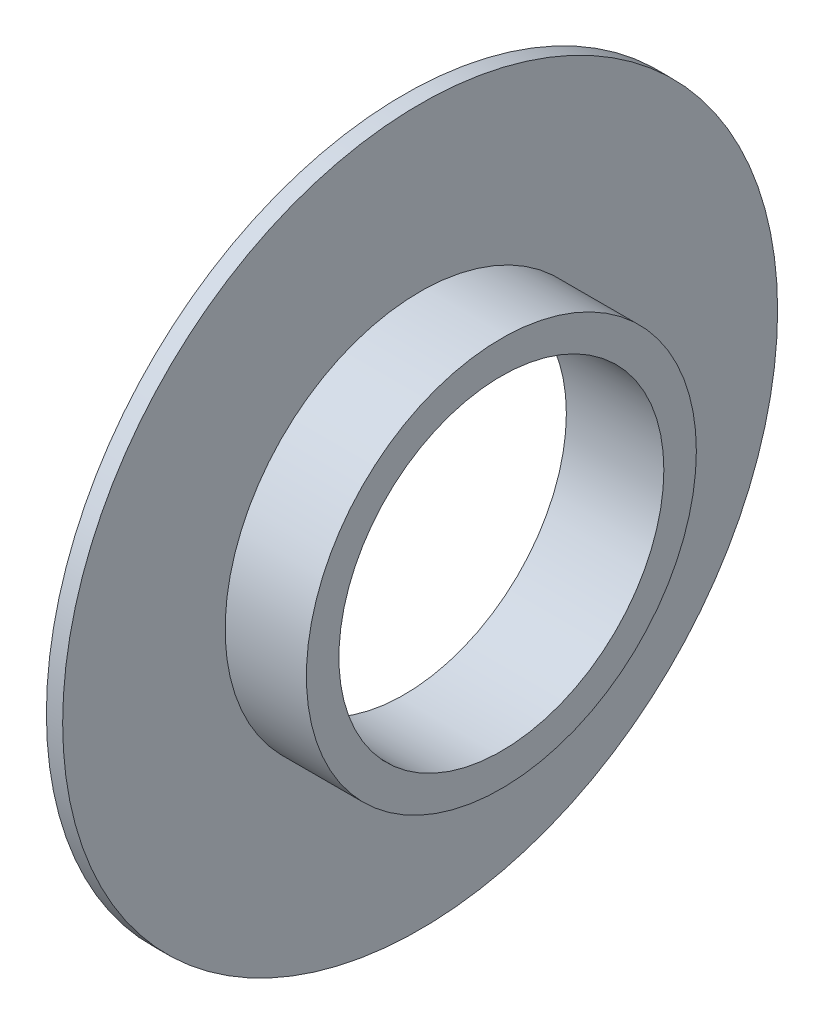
ISO-10303-21;
HEADER;
FILE_DESCRIPTION(('STEP AP214'),'2;1');
FILE_NAME('part.step','',(''),(''),'','','');
FILE_SCHEMA(('AUTOMOTIVE_DESIGN { 1 0 10303 214 1 1 1 1 }'));
ENDSEC;
DATA;
#1=APPLICATION_CONTEXT('core data for automotive mechanical design processes');
#2=APPLICATION_PROTOCOL_DEFINITION('international standard','automotive_design',2000,#1);
#3=PRODUCT_CONTEXT('',#1,'mechanical');
#4=PRODUCT('Part','Part','',(#3));
#5=PRODUCT_RELATED_PRODUCT_CATEGORY('part','',(#4));
#6=PRODUCT_DEFINITION_FORMATION('','',#4);
#7=PRODUCT_DEFINITION_CONTEXT('part definition',#1,'design');
#8=PRODUCT_DEFINITION('design','',#6,#7);
#9=PRODUCT_DEFINITION_SHAPE('','',#8);
#10=(LENGTH_UNIT() NAMED_UNIT(*) SI_UNIT(.MILLI.,.METRE.));
#11=(NAMED_UNIT(*) PLANE_ANGLE_UNIT() SI_UNIT($,.RADIAN.));
#12=(NAMED_UNIT(*) SI_UNIT($,.STERADIAN.) SOLID_ANGLE_UNIT());
#13=UNCERTAINTY_MEASURE_WITH_UNIT(LENGTH_MEASURE(1.E-05),#10,'distance_accuracy_value','');
#14=(GEOMETRIC_REPRESENTATION_CONTEXT(3) GLOBAL_UNCERTAINTY_ASSIGNED_CONTEXT((#13)) GLOBAL_UNIT_ASSIGNED_CONTEXT((#10,
#11,#12)) REPRESENTATION_CONTEXT('',''));
#15=CARTESIAN_POINT('',(0.,0.,0.));
#16=DIRECTION('',(0.,0.,1.));
#17=DIRECTION('',(1.,0.,0.));
#18=AXIS2_PLACEMENT_3D('',#15,#16,#17);
#19=CARTESIAN_POINT('',(0.,0.,0.));
#20=DIRECTION('',(1.,0.,0.));
#21=DIRECTION('',(0.,0.,-1.));
#22=AXIS2_PLACEMENT_3D('',#19,#20,#21);
#23=PLANE('',#22);
#24=CARTESIAN_POINT('',(0.,0.,0.));
#25=DIRECTION('',(1.,0.,0.));
#26=DIRECTION('',(0.,0.,-1.));
#27=AXIS2_PLACEMENT_3D('',#24,#25,#26);
#28=CIRCLE('',#27,5.);
#29=CARTESIAN_POINT('',(0.,0.,-5.));
#30=VERTEX_POINT('',#29);
#31=EDGE_CURVE('E50',#30,#30,#28,.T.);
#32=ORIENTED_EDGE('',*,*,#31,.F.);
#33=EDGE_LOOP('',(#32));
#34=FACE_BOUND('',#33,.T.);
#35=CARTESIAN_POINT('',(0.,0.,0.));
#36=DIRECTION('',(1.,0.,0.));
#37=DIRECTION('',(0.,0.,-1.));
#38=AXIS2_PLACEMENT_3D('',#35,#36,#37);
#39=CIRCLE('',#38,6.);
#40=CARTESIAN_POINT('',(0.,0.,-6.));
#41=VERTEX_POINT('',#40);
#42=EDGE_CURVE('E10',#41,#41,#39,.T.);
#43=ORIENTED_EDGE('',*,*,#42,.T.);
#44=EDGE_LOOP('',(#43));
#45=FACE_BOUND('',#44,.T.);
#46=ADVANCED_FACE('F30',(#34,#45),#23,.T.);
#47=CARTESIAN_POINT('',(0.,0.,0.));
#48=DIRECTION('',(1.,0.,0.));
#49=DIRECTION('',(0.,0.,-1.));
#50=AXIS2_PLACEMENT_3D('',#47,#48,#49);
#51=CYLINDRICAL_SURFACE('',#50,6.);
#52=CARTESIAN_POINT('',(-2.5,0.,0.));
#53=DIRECTION('',(1.,0.,0.));
#54=DIRECTION('',(0.,0.,-1.));
#55=AXIS2_PLACEMENT_3D('',#52,#53,#54);
#56=CIRCLE('',#55,6.);
#57=CARTESIAN_POINT('',(-2.5,0.,-6.));
#58=VERTEX_POINT('',#57);
#59=EDGE_CURVE('E36',#58,#58,#56,.T.);
#60=ORIENTED_EDGE('',*,*,#59,.T.);
#61=EDGE_LOOP('',(#60));
#62=FACE_BOUND('',#61,.T.);
#63=ORIENTED_EDGE('',*,*,#42,.F.);
#64=EDGE_LOOP('',(#63));
#65=FACE_BOUND('',#64,.T.);
#66=ADVANCED_FACE('F66',(#62,#65),#51,.T.);
#67=CARTESIAN_POINT('',(-2.5,0.,-6.));
#68=DIRECTION('',(1.,0.,0.));
#69=DIRECTION('',(0.,0.,-1.));
#70=AXIS2_PLACEMENT_3D('',#67,#68,#69);
#71=PLANE('',#70);
#72=CARTESIAN_POINT('',(-2.5,0.,0.));
#73=DIRECTION('',(1.,0.,0.));
#74=DIRECTION('',(0.,0.,-1.));
#75=AXIS2_PLACEMENT_3D('',#72,#73,#74);
#76=CIRCLE('',#75,11.);
#77=CARTESIAN_POINT('',(-2.5,0.,-11.));
#78=VERTEX_POINT('',#77);
#79=EDGE_CURVE('E40',#78,#78,#76,.T.);
#80=ORIENTED_EDGE('',*,*,#79,.T.);
#81=EDGE_LOOP('',(#80));
#82=FACE_BOUND('',#81,.T.);
#83=ORIENTED_EDGE('',*,*,#59,.F.);
#84=EDGE_LOOP('',(#83));
#85=FACE_BOUND('',#84,.T.);
#86=ADVANCED_FACE('F70',(#82,#85),#71,.T.);
#87=CARTESIAN_POINT('',(0.,0.,0.));
#88=DIRECTION('',(1.,0.,0.));
#89=DIRECTION('',(0.,0.,-1.));
#90=AXIS2_PLACEMENT_3D('',#87,#88,#89);
#91=CYLINDRICAL_SURFACE('',#90,11.);
#92=CARTESIAN_POINT('',(-3.,0.,0.));
#93=DIRECTION('',(1.,0.,0.));
#94=DIRECTION('',(0.,0.,-1.));
#95=AXIS2_PLACEMENT_3D('',#92,#93,#94);
#96=CIRCLE('',#95,11.);
#97=CARTESIAN_POINT('',(-3.,0.,-11.));
#98=VERTEX_POINT('',#97);
#99=EDGE_CURVE('E44',#98,#98,#96,.T.);
#100=ORIENTED_EDGE('',*,*,#99,.T.);
#101=EDGE_LOOP('',(#100));
#102=FACE_BOUND('',#101,.T.);
#103=ORIENTED_EDGE('',*,*,#79,.F.);
#104=EDGE_LOOP('',(#103));
#105=FACE_BOUND('',#104,.T.);
#106=ADVANCED_FACE('F74',(#102,#105),#91,.T.);
#107=CARTESIAN_POINT('',(-3.,0.,-11.));
#108=DIRECTION('',(-1.,0.,0.));
#109=DIRECTION('',(0.,0.,1.));
#110=AXIS2_PLACEMENT_3D('',#107,#108,#109);
#111=PLANE('',#110);
#112=CARTESIAN_POINT('',(-3.,0.,0.));
#113=DIRECTION('',(1.,0.,0.));
#114=DIRECTION('',(0.,0.,-1.));
#115=AXIS2_PLACEMENT_3D('',#112,#113,#114);
#116=CIRCLE('',#115,5.);
#117=CARTESIAN_POINT('',(-3.,0.,-5.));
#118=VERTEX_POINT('',#117);
#119=EDGE_CURVE('E49',#118,#118,#116,.T.);
#120=ORIENTED_EDGE('',*,*,#119,.T.);
#121=EDGE_LOOP('',(#120));
#122=FACE_BOUND('',#121,.T.);
#123=ORIENTED_EDGE('',*,*,#99,.F.);
#124=EDGE_LOOP('',(#123));
#125=FACE_BOUND('',#124,.T.);
#126=ADVANCED_FACE('F56',(#122,#125),#111,.T.);
#127=CARTESIAN_POINT('',(-3.,0.,0.));
#128=DIRECTION('',(1.,0.,0.));
#129=DIRECTION('',(0.,0.,-1.));
#130=AXIS2_PLACEMENT_3D('',#127,#128,#129);
#131=CYLINDRICAL_SURFACE('',#130,5.);
#132=ORIENTED_EDGE('',*,*,#119,.F.);
#133=EDGE_LOOP('',(#132));
#134=FACE_BOUND('',#133,.T.);
#135=ORIENTED_EDGE('',*,*,#31,.T.);
#136=EDGE_LOOP('',(#135));
#137=FACE_BOUND('',#136,.T.);
#138=ADVANCED_FACE('F59',(#134,#137),#131,.F.);
#139=CLOSED_SHELL('',(#46,#66,#86,#106,#126,#138));
#140=MANIFOLD_SOLID_BREP('B2',#139);
#141=ADVANCED_BREP_SHAPE_REPRESENTATION('',(#18,#140),#14);
#142=SHAPE_DEFINITION_REPRESENTATION(#9,#141);
ENDSEC;
END-ISO-10303-21;
